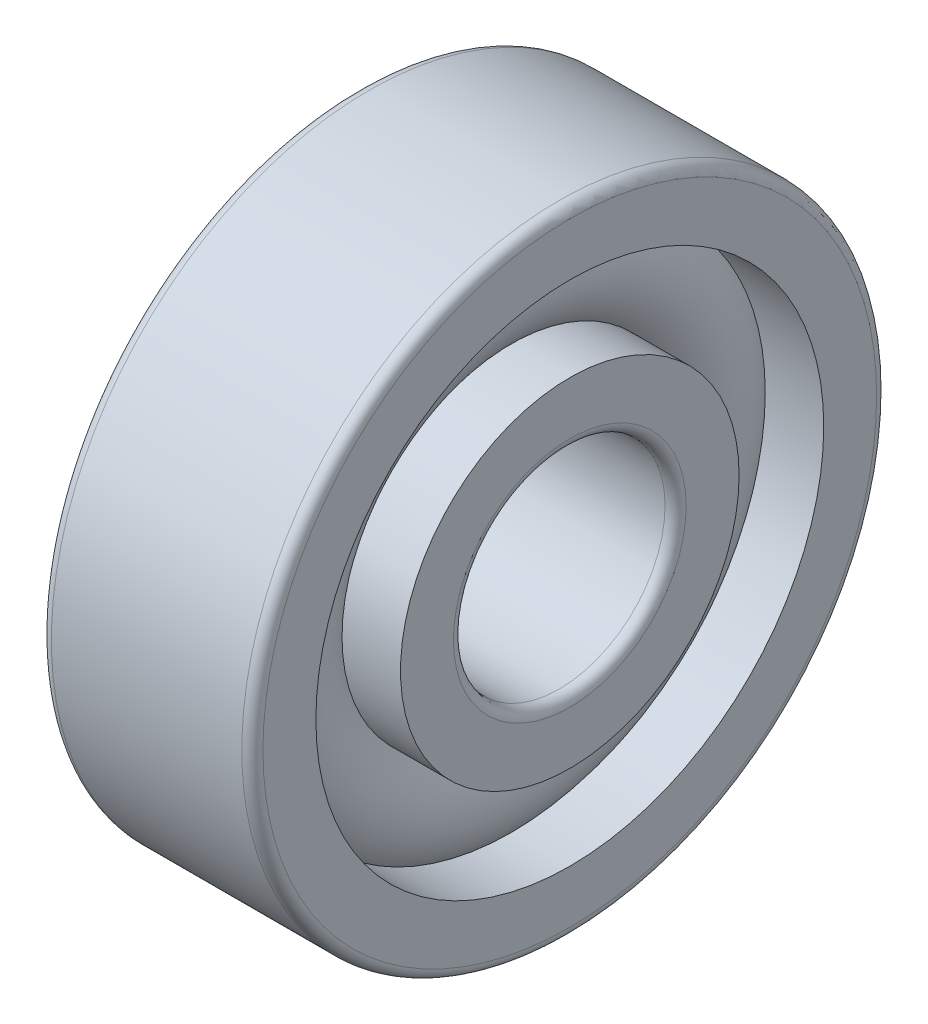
ISO-10303-21;
HEADER;
FILE_DESCRIPTION(('STEP AP214'),'2;1');
FILE_NAME('part.step','',(''),(''),'','','');
FILE_SCHEMA(('AUTOMOTIVE_DESIGN { 1 0 10303 214 1 1 1 1 }'));
ENDSEC;
DATA;
#1=APPLICATION_CONTEXT('core data for automotive mechanical design processes');
#2=APPLICATION_PROTOCOL_DEFINITION('international standard','automotive_design',2000,#1);
#3=PRODUCT_CONTEXT('',#1,'mechanical');
#4=PRODUCT('Part','Part','',(#3));
#5=PRODUCT_RELATED_PRODUCT_CATEGORY('part','',(#4));
#6=PRODUCT_DEFINITION_FORMATION('','',#4);
#7=PRODUCT_DEFINITION_CONTEXT('part definition',#1,'design');
#8=PRODUCT_DEFINITION('design','',#6,#7);
#9=PRODUCT_DEFINITION_SHAPE('','',#8);
#10=(LENGTH_UNIT() NAMED_UNIT(*) SI_UNIT(.MILLI.,.METRE.));
#11=(NAMED_UNIT(*) PLANE_ANGLE_UNIT() SI_UNIT($,.RADIAN.));
#12=(NAMED_UNIT(*) SI_UNIT($,.STERADIAN.) SOLID_ANGLE_UNIT());
#13=UNCERTAINTY_MEASURE_WITH_UNIT(LENGTH_MEASURE(1.E-05),#10,'distance_accuracy_value','');
#14=(GEOMETRIC_REPRESENTATION_CONTEXT(3) GLOBAL_UNCERTAINTY_ASSIGNED_CONTEXT((#13)) GLOBAL_UNIT_ASSIGNED_CONTEXT((#10,
#11,#12)) REPRESENTATION_CONTEXT('',''));
#15=CARTESIAN_POINT('',(0.,0.,0.));
#16=DIRECTION('',(0.,0.,1.));
#17=DIRECTION('',(1.,0.,0.));
#18=AXIS2_PLACEMENT_3D('',#15,#16,#17);
#19=CARTESIAN_POINT('',(0.,0.,0.));
#20=DIRECTION('',(-1.,0.,0.));
#21=DIRECTION('',(0.,0.,1.));
#22=AXIS2_PLACEMENT_3D('',#19,#20,#21);
#23=TOROIDAL_SURFACE('',#22,4.,1.2);
#24=CARTESIAN_POINT('',(0.894427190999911,0.,0.));
#25=DIRECTION('',(-1.,0.,0.));
#26=DIRECTION('',(0.,0.,1.));
#27=AXIS2_PLACEMENT_3D('',#24,#25,#26);
#28=CIRCLE('',#27,4.80000000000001);
#29=CARTESIAN_POINT('',(0.894427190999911,0.,4.80000000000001));
#30=VERTEX_POINT('',#29);
#31=EDGE_CURVE('E37',#30,#30,#28,.F.);
#32=ORIENTED_EDGE('',*,*,#31,.T.);
#33=EDGE_LOOP('',(#32));
#34=FACE_BOUND('',#33,.T.);
#35=CARTESIAN_POINT('',(0.894427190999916,0.,0.));
#36=DIRECTION('',(-1.,0.,0.));
#37=DIRECTION('',(0.,0.,1.));
#38=AXIS2_PLACEMENT_3D('',#35,#36,#37);
#39=CIRCLE('',#38,3.2);
#40=CARTESIAN_POINT('',(0.894427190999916,0.,3.2));
#41=VERTEX_POINT('',#40);
#42=EDGE_CURVE('E10',#41,#41,#39,.T.);
#43=ORIENTED_EDGE('',*,*,#42,.T.);
#44=EDGE_LOOP('',(#43));
#45=FACE_BOUND('',#44,.T.);
#46=ADVANCED_FACE('F33',(#34,#45),#23,.T.);
#47=CARTESIAN_POINT('',(-20.6375,0.,0.));
#48=DIRECTION('',(1.,0.,0.));
#49=DIRECTION('',(0.,0.,-1.));
#50=AXIS2_PLACEMENT_3D('',#47,#48,#49);
#51=CYLINDRICAL_SURFACE('',#50,3.2);
#52=CARTESIAN_POINT('',(2.,0.,0.));
#53=DIRECTION('',(1.,0.,0.));
#54=DIRECTION('',(0.,0.,-1.));
#55=AXIS2_PLACEMENT_3D('',#52,#53,#54);
#56=CIRCLE('',#55,3.2);
#57=CARTESIAN_POINT('',(2.,0.,-3.2));
#58=VERTEX_POINT('',#57);
#59=EDGE_CURVE('E46',#58,#58,#56,.T.);
#60=ORIENTED_EDGE('',*,*,#59,.F.);
#61=EDGE_LOOP('',(#60));
#62=FACE_BOUND('',#61,.T.);
#63=ORIENTED_EDGE('',*,*,#42,.F.);
#64=EDGE_LOOP('',(#63));
#65=FACE_BOUND('',#64,.T.);
#66=ADVANCED_FACE('F85',(#62,#65),#51,.T.);
#67=CARTESIAN_POINT('',(-20.6375,0.,0.));
#68=DIRECTION('',(1.,0.,0.));
#69=DIRECTION('',(0.,0.,-1.));
#70=AXIS2_PLACEMENT_3D('',#67,#68,#69);
#71=CYLINDRICAL_SURFACE('',#70,3.2);
#72=CARTESIAN_POINT('',(-2.,0.,0.));
#73=DIRECTION('',(1.,0.,0.));
#74=DIRECTION('',(0.,0.,-1.));
#75=AXIS2_PLACEMENT_3D('',#72,#73,#74);
#76=CIRCLE('',#75,3.2);
#77=CARTESIAN_POINT('',(-2.,0.,-3.2));
#78=VERTEX_POINT('',#77);
#79=EDGE_CURVE('E55',#78,#78,#76,.T.);
#80=ORIENTED_EDGE('',*,*,#79,.T.);
#81=EDGE_LOOP('',(#80));
#82=FACE_BOUND('',#81,.T.);
#83=CARTESIAN_POINT('',(-0.894427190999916,0.,0.));
#84=DIRECTION('',(1.,0.,0.));
#85=DIRECTION('',(0.,0.,-1.));
#86=AXIS2_PLACEMENT_3D('',#83,#84,#85);
#87=CIRCLE('',#86,3.2);
#88=CARTESIAN_POINT('',(-0.894427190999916,0.,-3.2));
#89=VERTEX_POINT('',#88);
#90=EDGE_CURVE('E41',#89,#89,#87,.T.);
#91=ORIENTED_EDGE('',*,*,#90,.F.);
#92=EDGE_LOOP('',(#91));
#93=FACE_BOUND('',#92,.T.);
#94=ADVANCED_FACE('F88',(#82,#93),#71,.T.);
#95=CARTESIAN_POINT('',(2.,2.2,0.));
#96=DIRECTION('',(1.,0.,0.));
#97=DIRECTION('',(0.,0.,-1.));
#98=AXIS2_PLACEMENT_3D('',#95,#96,#97);
#99=PLANE('',#98);
#100=ORIENTED_EDGE('',*,*,#59,.T.);
#101=EDGE_LOOP('',(#100));
#102=FACE_BOUND('',#101,.T.);
#103=CARTESIAN_POINT('',(2.,0.,0.));
#104=DIRECTION('',(1.,0.,0.));
#105=DIRECTION('',(0.,0.,-1.));
#106=AXIS2_PLACEMENT_3D('',#103,#104,#105);
#107=CIRCLE('',#106,2.2);
#108=CARTESIAN_POINT('',(2.,0.,-2.2));
#109=VERTEX_POINT('',#108);
#110=EDGE_CURVE('E77',#109,#109,#107,.T.);
#111=ORIENTED_EDGE('',*,*,#110,.F.);
#112=EDGE_LOOP('',(#111));
#113=FACE_BOUND('',#112,.T.);
#114=ADVANCED_FACE('F82',(#102,#113),#99,.T.);
#115=CARTESIAN_POINT('',(1.8,0.,0.));
#116=DIRECTION('',(1.,0.,0.));
#117=DIRECTION('',(0.,0.,-1.));
#118=AXIS2_PLACEMENT_3D('',#115,#116,#117);
#119=TOROIDAL_SURFACE('',#118,2.2,0.2);
#120=ORIENTED_EDGE('',*,*,#110,.T.);
#121=EDGE_LOOP('',(#120));
#122=FACE_BOUND('',#121,.T.);
#123=CARTESIAN_POINT('',(1.8,0.,0.));
#124=DIRECTION('',(1.,0.,0.));
#125=DIRECTION('',(0.,0.,-1.));
#126=AXIS2_PLACEMENT_3D('',#123,#124,#125);
#127=CIRCLE('',#126,2.);
#128=CARTESIAN_POINT('',(1.8,0.,-2.));
#129=VERTEX_POINT('',#128);
#130=EDGE_CURVE('E74',#129,#129,#127,.T.);
#131=ORIENTED_EDGE('',*,*,#130,.F.);
#132=EDGE_LOOP('',(#131));
#133=FACE_BOUND('',#132,.T.);
#134=ADVANCED_FACE('F99',(#122,#133),#119,.T.);
#135=CARTESIAN_POINT('',(-20.6375,0.,0.));
#136=DIRECTION('',(1.,0.,0.));
#137=DIRECTION('',(0.,0.,-1.));
#138=AXIS2_PLACEMENT_3D('',#135,#136,#137);
#139=CYLINDRICAL_SURFACE('',#138,2.);
#140=ORIENTED_EDGE('',*,*,#130,.T.);
#141=EDGE_LOOP('',(#140));
#142=FACE_BOUND('',#141,.T.);
#143=CARTESIAN_POINT('',(-1.8,0.,0.));
#144=DIRECTION('',(1.,0.,0.));
#145=DIRECTION('',(0.,0.,-1.));
#146=AXIS2_PLACEMENT_3D('',#143,#144,#145);
#147=CIRCLE('',#146,2.);
#148=CARTESIAN_POINT('',(-1.8,0.,-2.));
#149=VERTEX_POINT('',#148);
#150=EDGE_CURVE('E71',#149,#149,#147,.T.);
#151=ORIENTED_EDGE('',*,*,#150,.F.);
#152=EDGE_LOOP('',(#151));
#153=FACE_BOUND('',#152,.T.);
#154=ADVANCED_FACE('F102',(#142,#153),#139,.F.);
#155=CARTESIAN_POINT('',(-1.8,0.,0.));
#156=DIRECTION('',(1.,0.,0.));
#157=DIRECTION('',(0.,0.,-1.));
#158=AXIS2_PLACEMENT_3D('',#155,#156,#157);
#159=TOROIDAL_SURFACE('',#158,2.2,0.2);
#160=ORIENTED_EDGE('',*,*,#150,.T.);
#161=EDGE_LOOP('',(#160));
#162=FACE_BOUND('',#161,.T.);
#163=CARTESIAN_POINT('',(-2.,0.,0.));
#164=DIRECTION('',(1.,0.,0.));
#165=DIRECTION('',(0.,0.,-1.));
#166=AXIS2_PLACEMENT_3D('',#163,#164,#165);
#167=CIRCLE('',#166,2.2);
#168=CARTESIAN_POINT('',(-2.,0.,-2.2));
#169=VERTEX_POINT('',#168);
#170=EDGE_CURVE('E68',#169,#169,#167,.T.);
#171=ORIENTED_EDGE('',*,*,#170,.F.);
#172=EDGE_LOOP('',(#171));
#173=FACE_BOUND('',#172,.T.);
#174=ADVANCED_FACE('F106',(#162,#173),#159,.T.);
#175=CARTESIAN_POINT('',(-2.,3.2,0.));
#176=DIRECTION('',(-1.,0.,0.));
#177=DIRECTION('',(0.,0.,1.));
#178=AXIS2_PLACEMENT_3D('',#175,#176,#177);
#179=PLANE('',#178);
#180=ORIENTED_EDGE('',*,*,#170,.T.);
#181=EDGE_LOOP('',(#180));
#182=FACE_BOUND('',#181,.T.);
#183=ORIENTED_EDGE('',*,*,#79,.F.);
#184=EDGE_LOOP('',(#183));
#185=FACE_BOUND('',#184,.T.);
#186=ADVANCED_FACE('F110',(#182,#185),#179,.T.);
#187=CARTESIAN_POINT('',(-0.894427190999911,0.,0.));
#188=DIRECTION('',(1.,0.,0.));
#189=DIRECTION('',(0.,0.,-1.));
#190=AXIS2_PLACEMENT_3D('',#187,#188,#189);
#191=CIRCLE('',#190,4.80000000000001);
#192=CARTESIAN_POINT('',(-0.894427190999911,0.,-4.80000000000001));
#193=VERTEX_POINT('',#192);
#194=EDGE_CURVE('E49',#193,#193,#191,.F.);
#195=ORIENTED_EDGE('',*,*,#194,.T.);
#196=EDGE_LOOP('',(#195));
#197=FACE_BOUND('',#196,.T.);
#198=ORIENTED_EDGE('',*,*,#90,.T.);
#199=EDGE_LOOP('',(#198));
#200=FACE_BOUND('',#199,.T.);
#201=ADVANCED_FACE('F35',(#197,#200),#23,.T.);
#202=CARTESIAN_POINT('',(-20.6375,0.,0.));
#203=DIRECTION('',(1.,0.,0.));
#204=DIRECTION('',(0.,0.,-1.));
#205=AXIS2_PLACEMENT_3D('',#202,#203,#204);
#206=CYLINDRICAL_SURFACE('',#205,4.80000000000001);
#207=CARTESIAN_POINT('',(2.,0.,0.));
#208=DIRECTION('',(1.,0.,0.));
#209=DIRECTION('',(0.,0.,-1.));
#210=AXIS2_PLACEMENT_3D('',#207,#208,#209);
#211=CIRCLE('',#210,4.80000000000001);
#212=CARTESIAN_POINT('',(2.,0.,-4.80000000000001));
#213=VERTEX_POINT('',#212);
#214=EDGE_CURVE('E51',#213,#213,#211,.T.);
#215=ORIENTED_EDGE('',*,*,#214,.T.);
#216=EDGE_LOOP('',(#215));
#217=FACE_BOUND('',#216,.T.);
#218=ORIENTED_EDGE('',*,*,#31,.F.);
#219=EDGE_LOOP('',(#218));
#220=FACE_BOUND('',#219,.T.);
#221=ADVANCED_FACE('F115',(#217,#220),#206,.F.);
#222=CARTESIAN_POINT('',(-20.6375,0.,0.));
#223=DIRECTION('',(1.,0.,0.));
#224=DIRECTION('',(0.,0.,-1.));
#225=AXIS2_PLACEMENT_3D('',#222,#223,#224);
#226=CYLINDRICAL_SURFACE('',#225,4.80000000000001);
#227=CARTESIAN_POINT('',(-2.,0.,0.));
#228=DIRECTION('',(1.,0.,0.));
#229=DIRECTION('',(0.,0.,-1.));
#230=AXIS2_PLACEMENT_3D('',#227,#228,#229);
#231=CIRCLE('',#230,4.80000000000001);
#232=CARTESIAN_POINT('',(-2.,0.,-4.80000000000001));
#233=VERTEX_POINT('',#232);
#234=EDGE_CURVE('E146',#233,#233,#231,.T.);
#235=ORIENTED_EDGE('',*,*,#234,.F.);
#236=EDGE_LOOP('',(#235));
#237=FACE_BOUND('',#236,.T.);
#238=ORIENTED_EDGE('',*,*,#194,.F.);
#239=EDGE_LOOP('',(#238));
#240=FACE_BOUND('',#239,.T.);
#241=ADVANCED_FACE('F118',(#237,#240),#226,.F.);
#242=CARTESIAN_POINT('',(2.,5.80000000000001,0.));
#243=DIRECTION('',(1.,0.,0.));
#244=DIRECTION('',(0.,0.,-1.));
#245=AXIS2_PLACEMENT_3D('',#242,#243,#244);
#246=PLANE('',#245);
#247=CARTESIAN_POINT('',(2.,0.,0.));
#248=DIRECTION('',(1.,0.,0.));
#249=DIRECTION('',(0.,0.,-1.));
#250=AXIS2_PLACEMENT_3D('',#247,#248,#249);
#251=CIRCLE('',#250,5.80000000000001);
#252=CARTESIAN_POINT('',(2.,0.,-5.80000000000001));
#253=VERTEX_POINT('',#252);
#254=EDGE_CURVE('E57',#253,#253,#251,.T.);
#255=ORIENTED_EDGE('',*,*,#254,.T.);
#256=EDGE_LOOP('',(#255));
#257=FACE_BOUND('',#256,.T.);
#258=ORIENTED_EDGE('',*,*,#214,.F.);
#259=EDGE_LOOP('',(#258));
#260=FACE_BOUND('',#259,.T.);
#261=ADVANCED_FACE('F119',(#257,#260),#246,.T.);
#262=CARTESIAN_POINT('',(1.8,0.,0.));
#263=DIRECTION('',(1.,0.,0.));
#264=DIRECTION('',(0.,0.,-1.));
#265=AXIS2_PLACEMENT_3D('',#262,#263,#264);
#266=TOROIDAL_SURFACE('',#265,5.80000000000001,0.199999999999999);
#267=CARTESIAN_POINT('',(1.8,0.,0.));
#268=DIRECTION('',(1.,0.,0.));
#269=DIRECTION('',(0.,0.,-1.));
#270=AXIS2_PLACEMENT_3D('',#267,#268,#269);
#271=CIRCLE('',#270,6.);
#272=CARTESIAN_POINT('',(1.8,0.,-6.));
#273=VERTEX_POINT('',#272);
#274=EDGE_CURVE('E62',#273,#273,#271,.T.);
#275=ORIENTED_EDGE('',*,*,#274,.T.);
#276=EDGE_LOOP('',(#275));
#277=FACE_BOUND('',#276,.T.);
#278=ORIENTED_EDGE('',*,*,#254,.F.);
#279=EDGE_LOOP('',(#278));
#280=FACE_BOUND('',#279,.T.);
#281=ADVANCED_FACE('F122',(#277,#280),#266,.T.);
#282=CARTESIAN_POINT('',(-20.6375,0.,0.));
#283=DIRECTION('',(1.,0.,0.));
#284=DIRECTION('',(0.,0.,-1.));
#285=AXIS2_PLACEMENT_3D('',#282,#283,#284);
#286=CYLINDRICAL_SURFACE('',#285,6.00000000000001);
#287=CARTESIAN_POINT('',(-1.8,0.,0.));
#288=DIRECTION('',(1.,0.,0.));
#289=DIRECTION('',(0.,0.,-1.));
#290=AXIS2_PLACEMENT_3D('',#287,#288,#289);
#291=CIRCLE('',#290,6.00000000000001);
#292=CARTESIAN_POINT('',(-1.8,0.,-6.00000000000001));
#293=VERTEX_POINT('',#292);
#294=EDGE_CURVE('E150',#293,#293,#291,.T.);
#295=ORIENTED_EDGE('',*,*,#294,.T.);
#296=EDGE_LOOP('',(#295));
#297=FACE_BOUND('',#296,.T.);
#298=ORIENTED_EDGE('',*,*,#274,.F.);
#299=EDGE_LOOP('',(#298));
#300=FACE_BOUND('',#299,.T.);
#301=ADVANCED_FACE('F126',(#297,#300),#286,.T.);
#302=CARTESIAN_POINT('',(-1.8,0.,0.));
#303=DIRECTION('',(1.,0.,0.));
#304=DIRECTION('',(0.,0.,-1.));
#305=AXIS2_PLACEMENT_3D('',#302,#303,#304);
#306=TOROIDAL_SURFACE('',#305,5.80000000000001,0.199999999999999);
#307=CARTESIAN_POINT('',(-2.,0.,0.));
#308=DIRECTION('',(1.,0.,0.));
#309=DIRECTION('',(0.,0.,-1.));
#310=AXIS2_PLACEMENT_3D('',#307,#308,#309);
#311=CIRCLE('',#310,5.80000000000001);
#312=CARTESIAN_POINT('',(-2.,0.,-5.80000000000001));
#313=VERTEX_POINT('',#312);
#314=EDGE_CURVE('E147',#313,#313,#311,.T.);
#315=ORIENTED_EDGE('',*,*,#314,.T.);
#316=EDGE_LOOP('',(#315));
#317=FACE_BOUND('',#316,.T.);
#318=ORIENTED_EDGE('',*,*,#294,.F.);
#319=EDGE_LOOP('',(#318));
#320=FACE_BOUND('',#319,.T.);
#321=ADVANCED_FACE('F130',(#317,#320),#306,.T.);
#322=CARTESIAN_POINT('',(-2.,4.80000000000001,0.));
#323=DIRECTION('',(-1.,0.,0.));
#324=DIRECTION('',(0.,0.,1.));
#325=AXIS2_PLACEMENT_3D('',#322,#323,#324);
#326=PLANE('',#325);
#327=ORIENTED_EDGE('',*,*,#234,.T.);
#328=EDGE_LOOP('',(#327));
#329=FACE_BOUND('',#328,.T.);
#330=ORIENTED_EDGE('',*,*,#314,.F.);
#331=EDGE_LOOP('',(#330));
#332=FACE_BOUND('',#331,.T.);
#333=ADVANCED_FACE('F134',(#329,#332),#326,.T.);
#334=CLOSED_SHELL('',(#46,#66,#94,#114,#134,#154,#174,#186,#201,#221,#241,#261,#281,#301,#321,#333));
#335=MANIFOLD_SOLID_BREP('B2',#334);
#336=ADVANCED_BREP_SHAPE_REPRESENTATION('',(#18,#335),#14);
#337=SHAPE_DEFINITION_REPRESENTATION(#9,#336);
ENDSEC;
END-ISO-10303-21;
